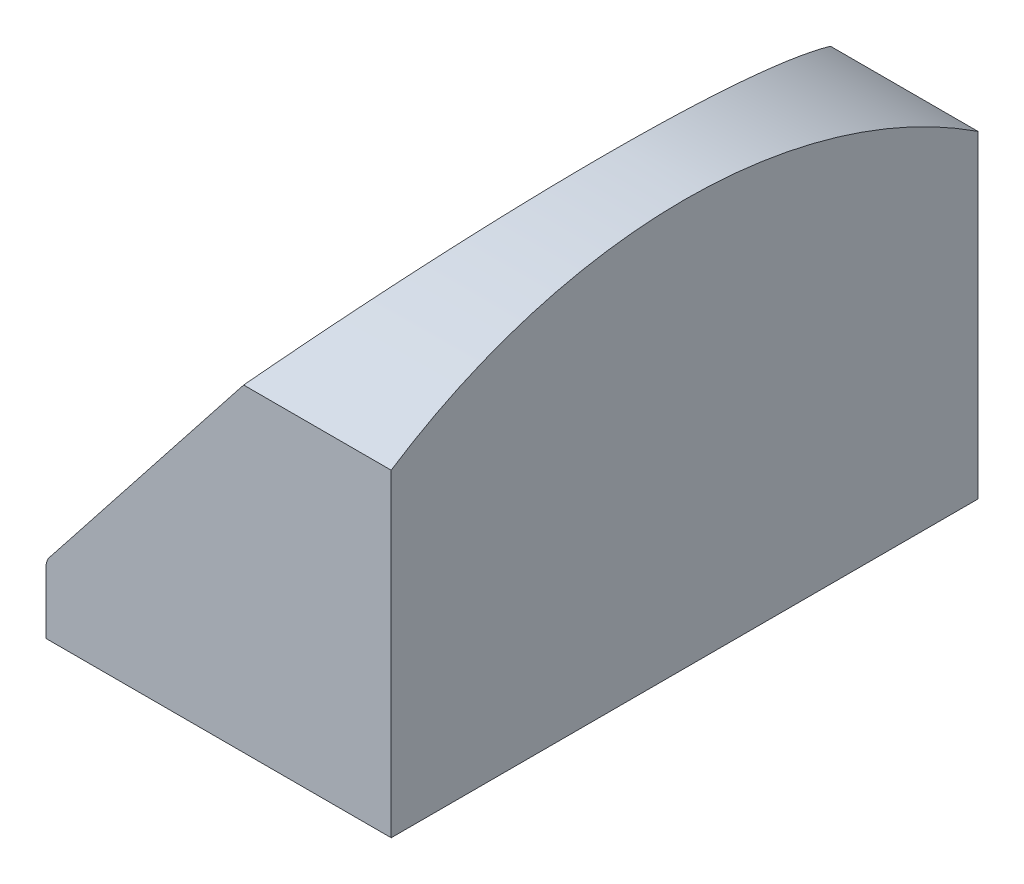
ISO-10303-21;
HEADER;
FILE_DESCRIPTION(('STEP AP214'),'2;1');
FILE_NAME('part.step','',(''),(''),'','','');
FILE_SCHEMA(('AUTOMOTIVE_DESIGN { 1 0 10303 214 1 1 1 1 }'));
ENDSEC;
DATA;
#1=APPLICATION_CONTEXT('core data for automotive mechanical design processes');
#2=APPLICATION_PROTOCOL_DEFINITION('international standard','automotive_design',2000,#1);
#3=PRODUCT_CONTEXT('',#1,'mechanical');
#4=PRODUCT('Part','Part','',(#3));
#5=PRODUCT_RELATED_PRODUCT_CATEGORY('part','',(#4));
#6=PRODUCT_DEFINITION_FORMATION('','',#4);
#7=PRODUCT_DEFINITION_CONTEXT('part definition',#1,'design');
#8=PRODUCT_DEFINITION('design','',#6,#7);
#9=PRODUCT_DEFINITION_SHAPE('','',#8);
#10=(LENGTH_UNIT() NAMED_UNIT(*) SI_UNIT(.MILLI.,.METRE.));
#11=(NAMED_UNIT(*) PLANE_ANGLE_UNIT() SI_UNIT($,.RADIAN.));
#12=(NAMED_UNIT(*) SI_UNIT($,.STERADIAN.) SOLID_ANGLE_UNIT());
#13=UNCERTAINTY_MEASURE_WITH_UNIT(LENGTH_MEASURE(1.E-05),#10,'distance_accuracy_value','');
#14=(GEOMETRIC_REPRESENTATION_CONTEXT(3) GLOBAL_UNCERTAINTY_ASSIGNED_CONTEXT((#13)) GLOBAL_UNIT_ASSIGNED_CONTEXT((#10,
#11,#12)) REPRESENTATION_CONTEXT('',''));
#15=CARTESIAN_POINT('',(0.,0.,0.));
#16=DIRECTION('',(0.,0.,1.));
#17=DIRECTION('',(1.,0.,0.));
#18=AXIS2_PLACEMENT_3D('',#15,#16,#17);
#19=CARTESIAN_POINT('',(0.164316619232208,1.35733725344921,8.49999999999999));
#20=DIRECTION('',(0.78543046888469,-0.618949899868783,0.));
#21=DIRECTION('',(0.618949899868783,0.78543046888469,0.));
#22=AXIS2_PLACEMENT_3D('',#19,#20,#21);
#23=PLANE('',#22);
#24=CARTESIAN_POINT('',(0.164316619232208,1.35733725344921,8.49999999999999));
#25=DIRECTION('',(-0.78543046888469,0.618949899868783,0.));
#26=DIRECTION('',(0.618949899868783,0.78543046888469,0.));
#27=AXIS2_PLACEMENT_3D('',#24,#25,#26);
#28=CIRCLE('',#27,12.1981012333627);
#29=CARTESIAN_POINT('',(6.11859129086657,8.91314871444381,16.));
#30=VERTEX_POINT('',#29);
#31=CARTESIAN_POINT('',(6.11859129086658,8.91314871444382,1.));
#32=VERTEX_POINT('',#31);
#33=EDGE_CURVE('E275',#30,#32,#28,.T.);
#34=ORIENTED_EDGE('',*,*,#33,.T.);
#35=DIRECTION('',(-0.618949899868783,-0.78543046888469,0.));
#36=VECTOR('',#35,1.);
#37=CARTESIAN_POINT('',(6.11859129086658,8.91314871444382,1.));
#38=LINE('',#37,#36);
#39=CARTESIAN_POINT('',(1.1617008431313,2.62299051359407,1.));
#40=VERTEX_POINT('',#39);
#41=EDGE_CURVE('E278',#32,#40,#38,.T.);
#42=ORIENTED_EDGE('',*,*,#41,.T.);
#43=DIRECTION('',(0.,0.,1.));
#44=VECTOR('',#43,1.);
#45=CARTESIAN_POINT('',(1.1617008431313,2.62299051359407,16.));
#46=LINE('',#45,#44);
#47=CARTESIAN_POINT('',(1.1617008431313,2.62299051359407,16.));
#48=VERTEX_POINT('',#47);
#49=EDGE_CURVE('E281',#40,#48,#46,.T.);
#50=ORIENTED_EDGE('',*,*,#49,.T.);
#51=DIRECTION('',(0.618949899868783,0.78543046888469,0.));
#52=VECTOR('',#51,1.);
#53=CARTESIAN_POINT('',(6.11859129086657,8.91314871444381,16.));
#54=LINE('',#53,#52);
#55=EDGE_CURVE('E284',#48,#30,#54,.T.);
#56=ORIENTED_EDGE('',*,*,#55,.T.);
#57=EDGE_LOOP('',(#34,#42,#50,#56));
#58=FACE_BOUND('',#57,.T.);
#59=CARTESIAN_POINT('',(3.94708370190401,6.15756506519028,10.5164987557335));
#60=DIRECTION('',(0.78543046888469,-0.618949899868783,0.));
#61=DIRECTION('',(0.618949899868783,0.78543046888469,0.));
#62=AXIS2_PLACEMENT_3D('',#59,#60,#61);
#63=CIRCLE('',#62,0.999999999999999);
#64=CARTESIAN_POINT('',(4.23612825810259,6.52435468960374,9.63223713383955));
#65=VERTEX_POINT('',#64);
#66=CARTESIAN_POINT('',(4.21740882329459,6.50060023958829,11.4160826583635));
#67=VERTEX_POINT('',#66);
#68=EDGE_CURVE('E191',#65,#67,#63,.T.);
#69=ORIENTED_EDGE('',*,*,#68,.F.);
#70=DIRECTION('',(0.618949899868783,0.78543046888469,0.));
#71=VECTOR('',#70,1.);
#72=CARTESIAN_POINT('',(4.23612825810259,6.52435468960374,9.63223713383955));
#73=LINE('',#72,#71);
#74=CARTESIAN_POINT('',(2.70049657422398,4.57568014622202,9.63223713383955));
#75=VERTEX_POINT('',#74);
#76=EDGE_CURVE('E226',#75,#65,#73,.T.);
#77=ORIENTED_EDGE('',*,*,#76,.F.);
#78=DIRECTION('',(0.,0.,1.));
#79=VECTOR('',#78,1.);
#80=CARTESIAN_POINT('',(2.70049657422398,4.57568014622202,9.63223713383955));
#81=LINE('',#80,#79);
#82=CARTESIAN_POINT('',(2.70049657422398,4.57568014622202,6.49863786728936));
#83=VERTEX_POINT('',#82);
#84=EDGE_CURVE('E223',#83,#75,#81,.T.);
#85=ORIENTED_EDGE('',*,*,#84,.F.);
#86=DIRECTION('',(-0.618949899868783,-0.78543046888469,0.));
#87=VECTOR('',#86,1.);
#88=CARTESIAN_POINT('',(4.23612825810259,6.52435468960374,6.49863786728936));
#89=LINE('',#88,#87);
#90=CARTESIAN_POINT('',(4.23612825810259,6.52435468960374,6.49863786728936));
#91=VERTEX_POINT('',#90);
#92=EDGE_CURVE('E220',#91,#83,#89,.T.);
#93=ORIENTED_EDGE('',*,*,#92,.F.);
#94=DIRECTION('',(0.,0.,-1.));
#95=VECTOR('',#94,1.);
#96=CARTESIAN_POINT('',(4.23612825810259,6.52435468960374,8.88042420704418));
#97=LINE('',#96,#95);
#98=CARTESIAN_POINT('',(4.23612825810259,6.52435468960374,8.88042420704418));
#99=VERTEX_POINT('',#98);
#100=EDGE_CURVE('E217',#99,#91,#97,.T.);
#101=ORIENTED_EDGE('',*,*,#100,.F.);
#102=CARTESIAN_POINT('',(3.52413136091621,5.62085012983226,10.5164987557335));
#103=DIRECTION('',(-0.78543046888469,0.618949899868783,0.));
#104=DIRECTION('',(0.618949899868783,0.78543046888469,0.));
#105=AXIS2_PLACEMENT_3D('',#102,#103,#104);
#106=CIRCLE('',#105,2.);
#107=CARTESIAN_POINT('',(4.12939783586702,6.38891670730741,12.2611265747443));
#108=VERTEX_POINT('',#107);
#109=EDGE_CURVE('E50',#108,#99,#106,.T.);
#110=ORIENTED_EDGE('',*,*,#109,.F.);
#111=DIRECTION('',(-0.102705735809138,-0.130330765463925,0.986136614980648));
#112=VECTOR('',#111,1.);
#113=CARTESIAN_POINT('',(4.12939783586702,6.38891670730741,12.2611265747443));
#114=LINE('',#113,#112);
#115=EDGE_CURVE('E45',#67,#108,#114,.T.);
#116=ORIENTED_EDGE('',*,*,#115,.F.);
#117=EDGE_LOOP('',(#69,#77,#85,#93,#101,#110,#116));
#118=FACE_BOUND('',#117,.T.);
#119=ADVANCED_FACE('F30',(#58,#118),#23,.F.);
#120=CARTESIAN_POINT('',(0.,1.78992857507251,17.));
#121=DIRECTION('',(1.,0.,0.));
#122=DIRECTION('',(0.,1.,0.));
#123=AXIS2_PLACEMENT_3D('',#120,#121,#122);
#124=PLANE('',#123);
#125=DIRECTION('',(0.,-1.,0.));
#126=VECTOR('',#125,1.);
#127=CARTESIAN_POINT('',(0.,1.78992857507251,0.));
#128=LINE('',#127,#126);
#129=CARTESIAN_POINT('',(0.,1.78992857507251,0.));
#130=VERTEX_POINT('',#129);
#131=CARTESIAN_POINT('',(0.,0.,0.));
#132=VERTEX_POINT('',#131);
#133=EDGE_CURVE('E303',#130,#132,#128,.T.);
#134=ORIENTED_EDGE('',*,*,#133,.T.);
#135=DIRECTION('',(0.,0.,-1.));
#136=VECTOR('',#135,1.);
#137=CARTESIAN_POINT('',(0.,0.,17.));
#138=LINE('',#137,#136);
#139=CARTESIAN_POINT('',(0.,0.,17.));
#140=VERTEX_POINT('',#139);
#141=EDGE_CURVE('E38',#140,#132,#138,.T.);
#142=ORIENTED_EDGE('',*,*,#141,.F.);
#143=DIRECTION('',(0.,-1.,0.));
#144=VECTOR('',#143,1.);
#145=CARTESIAN_POINT('',(0.,1.78992857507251,17.));
#146=LINE('',#145,#144);
#147=CARTESIAN_POINT('',(0.,1.78992857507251,17.));
#148=VERTEX_POINT('',#147);
#149=EDGE_CURVE('E315',#148,#140,#146,.T.);
#150=ORIENTED_EDGE('',*,*,#149,.F.);
#151=DIRECTION('',(0.,0.,-1.));
#152=VECTOR('',#151,1.);
#153=CARTESIAN_POINT('',(0.,1.78992857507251,17.));
#154=LINE('',#153,#152);
#155=EDGE_CURVE('E327',#148,#130,#154,.T.);
#156=ORIENTED_EDGE('',*,*,#155,.T.);
#157=EDGE_LOOP('',(#134,#142,#150,#156));
#158=FACE_BOUND('',#157,.T.);
#159=ADVANCED_FACE('F32',(#158),#124,.F.);
#160=CARTESIAN_POINT('',(0.,0.,17.));
#161=DIRECTION('',(0.,1.,0.));
#162=DIRECTION('',(0.,0.,1.));
#163=AXIS2_PLACEMENT_3D('',#160,#161,#162);
#164=PLANE('',#163);
#165=DIRECTION('',(1.,0.,0.));
#166=VECTOR('',#165,1.);
#167=CARTESIAN_POINT('',(0.,0.,0.));
#168=LINE('',#167,#166);
#169=CARTESIAN_POINT('',(10.,0.,0.));
#170=VERTEX_POINT('',#169);
#171=EDGE_CURVE('E306',#132,#170,#168,.T.);
#172=ORIENTED_EDGE('',*,*,#171,.T.);
#173=DIRECTION('',(0.,0.,-1.));
#174=VECTOR('',#173,1.);
#175=CARTESIAN_POINT('',(10.,0.,17.));
#176=LINE('',#175,#174);
#177=CARTESIAN_POINT('',(10.,0.,17.));
#178=VERTEX_POINT('',#177);
#179=EDGE_CURVE('E333',#178,#170,#176,.T.);
#180=ORIENTED_EDGE('',*,*,#179,.F.);
#181=DIRECTION('',(1.,0.,0.));
#182=VECTOR('',#181,1.);
#183=CARTESIAN_POINT('',(0.,0.,17.));
#184=LINE('',#183,#182);
#185=EDGE_CURVE('E318',#140,#178,#184,.T.);
#186=ORIENTED_EDGE('',*,*,#185,.F.);
#187=ORIENTED_EDGE('',*,*,#141,.T.);
#188=EDGE_LOOP('',(#172,#180,#186,#187));
#189=FACE_BOUND('',#188,.T.);
#190=ADVANCED_FACE('F338',(#189),#164,.F.);
#191=CARTESIAN_POINT('',(10.,0.,17.));
#192=DIRECTION('',(-1.,0.,0.));
#193=DIRECTION('',(0.,0.,1.));
#194=AXIS2_PLACEMENT_3D('',#191,#192,#193);
#195=PLANE('',#194);
#196=DIRECTION('',(0.,1.,0.));
#197=VECTOR('',#196,1.);
#198=CARTESIAN_POINT('',(10.,0.,0.));
#199=LINE('',#198,#197);
#200=CARTESIAN_POINT('',(10.,9.2226236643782,0.));
#201=VERTEX_POINT('',#200);
#202=EDGE_CURVE('E308',#170,#201,#199,.T.);
#203=ORIENTED_EDGE('',*,*,#202,.T.);
#204=CARTESIAN_POINT('',(10.,-3.74245760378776,8.5));
#205=DIRECTION('',(-1.,0.,0.));
#206=DIRECTION('',(0.,-1.,0.));
#207=AXIS2_PLACEMENT_3D('',#204,#205,#206);
#208=CIRCLE('',#207,15.5030104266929);
#209=CARTESIAN_POINT('',(10.,9.2226236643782,17.));
#210=VERTEX_POINT('',#209);
#211=EDGE_CURVE('E290',#210,#201,#208,.T.);
#212=ORIENTED_EDGE('',*,*,#211,.F.);
#213=DIRECTION('',(0.,1.,0.));
#214=VECTOR('',#213,1.);
#215=CARTESIAN_POINT('',(10.,0.,17.));
#216=LINE('',#215,#214);
#217=EDGE_CURVE('E320',#178,#210,#216,.T.);
#218=ORIENTED_EDGE('',*,*,#217,.F.);
#219=ORIENTED_EDGE('',*,*,#179,.T.);
#220=EDGE_LOOP('',(#203,#212,#218,#219));
#221=FACE_BOUND('',#220,.T.);
#222=ADVANCED_FACE('F352',(#221),#195,.F.);
#223=CARTESIAN_POINT('',(7.75694931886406,11.8,17.));
#224=DIRECTION('',(0.78543046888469,-0.618949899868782,0.));
#225=DIRECTION('',(0.618949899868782,0.78543046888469,0.));
#226=AXIS2_PLACEMENT_3D('',#223,#224,#225);
#227=PLANE('',#226);
#228=DIRECTION('',(-0.618949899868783,-0.78543046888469,0.));
#229=VECTOR('',#228,1.);
#230=CARTESIAN_POINT('',(5.72587605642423,9.22262366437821,1.));
#231=LINE('',#230,#229);
#232=CARTESIAN_POINT('',(5.72587605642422,9.22262366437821,1.));
#233=VERTEX_POINT('',#232);
#234=CARTESIAN_POINT('',(0.768985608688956,2.93246546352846,1.));
#235=VERTEX_POINT('',#234);
#236=EDGE_CURVE('E266',#233,#235,#231,.T.);
#237=ORIENTED_EDGE('',*,*,#236,.F.);
#238=CARTESIAN_POINT('',(-0.228398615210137,1.6668122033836,8.49999999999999));
#239=DIRECTION('',(-0.78543046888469,0.618949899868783,0.));
#240=DIRECTION('',(0.618949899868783,0.78543046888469,0.));
#241=AXIS2_PLACEMENT_3D('',#238,#239,#240);
#242=CIRCLE('',#241,12.1981012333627);
#243=CARTESIAN_POINT('',(5.72587605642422,9.2226236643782,16.));
#244=VERTEX_POINT('',#243);
#245=EDGE_CURVE('E264',#244,#233,#242,.T.);
#246=ORIENTED_EDGE('',*,*,#245,.F.);
#247=DIRECTION('',(0.618949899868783,0.78543046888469,0.));
#248=VECTOR('',#247,1.);
#249=CARTESIAN_POINT('',(5.72587605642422,9.2226236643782,16.));
#250=LINE('',#249,#248);
#251=CARTESIAN_POINT('',(0.768985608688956,2.93246546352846,16.));
#252=VERTEX_POINT('',#251);
#253=EDGE_CURVE('E272',#252,#244,#250,.T.);
#254=ORIENTED_EDGE('',*,*,#253,.F.);
#255=DIRECTION('',(0.,0.,1.));
#256=VECTOR('',#255,1.);
#257=CARTESIAN_POINT('',(0.768985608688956,2.93246546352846,16.));
#258=LINE('',#257,#256);
#259=EDGE_CURVE('E269',#235,#252,#258,.T.);
#260=ORIENTED_EDGE('',*,*,#259,.F.);
#261=EDGE_LOOP('',(#237,#246,#254,#260));
#262=FACE_BOUND('',#261,.T.);
#263=DIRECTION('',(-0.618949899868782,-0.78543046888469,0.));
#264=VECTOR('',#263,1.);
#265=CARTESIAN_POINT('',(7.75694931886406,11.8,17.));
#266=LINE('',#265,#264);
#267=CARTESIAN_POINT('',(5.72587605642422,9.22262366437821,17.));
#268=VERTEX_POINT('',#267);
#269=CARTESIAN_POINT('',(0.150035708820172,2.14703499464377,17.));
#270=VERTEX_POINT('',#269);
#271=EDGE_CURVE('E323',#268,#270,#266,.T.);
#272=ORIENTED_EDGE('',*,*,#271,.F.);
#273=CARTESIAN_POINT('',(-4.4911145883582,-3.74245760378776,8.5));
#274=DIRECTION('',(0.78543046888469,-0.618949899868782,0.));
#275=DIRECTION('',(0.618949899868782,0.78543046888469,0.));
#276=AXIS2_PLACEMENT_3D('',#273,#274,#275);
#277=ELLIPSE('',#276,19.7382340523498,15.5030104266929);
#278=CARTESIAN_POINT('',(5.72587605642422,9.22262366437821,0.));
#279=VERTEX_POINT('',#278);
#280=EDGE_CURVE('E300',#268,#279,#277,.F.);
#281=ORIENTED_EDGE('',*,*,#280,.T.);
#282=DIRECTION('',(-0.618949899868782,-0.78543046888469,0.));
#283=VECTOR('',#282,1.);
#284=CARTESIAN_POINT('',(7.75694931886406,11.8,0.));
#285=LINE('',#284,#283);
#286=CARTESIAN_POINT('',(0.150035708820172,2.14703499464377,0.));
#287=VERTEX_POINT('',#286);
#288=EDGE_CURVE('E311',#279,#287,#285,.T.);
#289=ORIENTED_EDGE('',*,*,#288,.T.);
#290=DIRECTION('',(0.,0.,-1.));
#291=VECTOR('',#290,1.);
#292=CARTESIAN_POINT('',(0.150035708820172,2.14703499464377,17.));
#293=LINE('',#292,#291);
#294=EDGE_CURVE('E330',#270,#287,#293,.T.);
#295=ORIENTED_EDGE('',*,*,#294,.F.);
#296=EDGE_LOOP('',(#272,#281,#289,#295));
#297=FACE_BOUND('',#296,.T.);
#298=ADVANCED_FACE('F363',(#262,#297),#227,.F.);
#299=CARTESIAN_POINT('',(0.500000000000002,1.78992857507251,17.));
#300=DIRECTION('',(0.,0.,-1.));
#301=DIRECTION('',(-1.,0.,0.));
#302=AXIS2_PLACEMENT_3D('',#299,#300,#301);
#303=CYLINDRICAL_SURFACE('',#302,0.500000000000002);
#304=CARTESIAN_POINT('',(0.500000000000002,1.78992857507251,0.));
#305=DIRECTION('',(0.,0.,1.));
#306=DIRECTION('',(-1.,0.,0.));
#307=AXIS2_PLACEMENT_3D('',#304,#305,#306);
#308=CIRCLE('',#307,0.500000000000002);
#309=EDGE_CURVE('E313',#287,#130,#308,.T.);
#310=ORIENTED_EDGE('',*,*,#309,.T.);
#311=ORIENTED_EDGE('',*,*,#155,.F.);
#312=CARTESIAN_POINT('',(0.500000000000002,1.78992857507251,17.));
#313=DIRECTION('',(0.,0.,1.));
#314=DIRECTION('',(-1.,0.,0.));
#315=AXIS2_PLACEMENT_3D('',#312,#313,#314);
#316=CIRCLE('',#315,0.500000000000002);
#317=EDGE_CURVE('E325',#270,#148,#316,.T.);
#318=ORIENTED_EDGE('',*,*,#317,.F.);
#319=ORIENTED_EDGE('',*,*,#294,.T.);
#320=EDGE_LOOP('',(#310,#311,#318,#319));
#321=FACE_BOUND('',#320,.T.);
#322=ADVANCED_FACE('F361',(#321),#303,.T.);
#323=CARTESIAN_POINT('',(0.500000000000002,1.78992857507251,17.));
#324=DIRECTION('',(0.,0.,-1.));
#325=DIRECTION('',(-1.,0.,0.));
#326=AXIS2_PLACEMENT_3D('',#323,#324,#325);
#327=PLANE('',#326);
#328=ORIENTED_EDGE('',*,*,#217,.T.);
#329=DIRECTION('',(1.,0.,0.));
#330=VECTOR('',#329,1.);
#331=CARTESIAN_POINT('',(0.,9.22262366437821,17.));
#332=LINE('',#331,#330);
#333=EDGE_CURVE('E298',#268,#210,#332,.T.);
#334=ORIENTED_EDGE('',*,*,#333,.F.);
#335=ORIENTED_EDGE('',*,*,#271,.T.);
#336=ORIENTED_EDGE('',*,*,#317,.T.);
#337=ORIENTED_EDGE('',*,*,#149,.T.);
#338=ORIENTED_EDGE('',*,*,#185,.T.);
#339=EDGE_LOOP('',(#328,#334,#335,#336,#337,#338));
#340=FACE_BOUND('',#339,.T.);
#341=ADVANCED_FACE('F356',(#340),#327,.F.);
#342=CARTESIAN_POINT('',(0.500000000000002,1.78992857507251,0.));
#343=DIRECTION('',(0.,0.,-1.));
#344=DIRECTION('',(-1.,0.,0.));
#345=AXIS2_PLACEMENT_3D('',#342,#343,#344);
#346=PLANE('',#345);
#347=DIRECTION('',(-1.,0.,0.));
#348=VECTOR('',#347,1.);
#349=CARTESIAN_POINT('',(0.500000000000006,9.22262366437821,0.));
#350=LINE('',#349,#348);
#351=EDGE_CURVE('E11',#201,#279,#350,.T.);
#352=ORIENTED_EDGE('',*,*,#351,.F.);
#353=ORIENTED_EDGE('',*,*,#202,.F.);
#354=ORIENTED_EDGE('',*,*,#171,.F.);
#355=ORIENTED_EDGE('',*,*,#133,.F.);
#356=ORIENTED_EDGE('',*,*,#309,.F.);
#357=ORIENTED_EDGE('',*,*,#288,.F.);
#358=EDGE_LOOP('',(#352,#353,#354,#355,#356,#357));
#359=FACE_BOUND('',#358,.T.);
#360=ADVANCED_FACE('F347',(#359),#346,.T.);
#361=CARTESIAN_POINT('',(0.,-3.74245760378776,8.5));
#362=DIRECTION('',(1.,0.,0.));
#363=DIRECTION('',(0.,1.,0.));
#364=AXIS2_PLACEMENT_3D('',#361,#362,#363);
#365=CYLINDRICAL_SURFACE('',#364,15.5030104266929);
#366=ORIENTED_EDGE('',*,*,#333,.T.);
#367=ORIENTED_EDGE('',*,*,#211,.T.);
#368=ORIENTED_EDGE('',*,*,#351,.T.);
#369=ORIENTED_EDGE('',*,*,#280,.F.);
#370=EDGE_LOOP('',(#366,#367,#368,#369));
#371=FACE_BOUND('',#370,.T.);
#372=ADVANCED_FACE('F365',(#371),#365,.T.);
#373=CARTESIAN_POINT('',(0.164316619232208,1.35733725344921,8.49999999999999));
#374=DIRECTION('',(-0.78543046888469,0.618949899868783,0.));
#375=DIRECTION('',(-0.618949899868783,-0.78543046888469,0.));
#376=AXIS2_PLACEMENT_3D('',#373,#374,#375);
#377=CYLINDRICAL_SURFACE('',#376,12.1981012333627);
#378=ORIENTED_EDGE('',*,*,#245,.T.);
#379=DIRECTION('',(-0.78543046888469,0.618949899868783,0.));
#380=VECTOR('',#379,1.);
#381=CARTESIAN_POINT('',(6.11859129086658,8.91314871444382,1.));
#382=LINE('',#381,#380);
#383=EDGE_CURVE('E287',#32,#233,#382,.T.);
#384=ORIENTED_EDGE('',*,*,#383,.F.);
#385=ORIENTED_EDGE('',*,*,#33,.F.);
#386=DIRECTION('',(-0.78543046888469,0.618949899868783,0.));
#387=VECTOR('',#386,1.);
#388=CARTESIAN_POINT('',(6.11859129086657,8.91314871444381,16.));
#389=LINE('',#388,#387);
#390=EDGE_CURVE('E288',#30,#244,#389,.T.);
#391=ORIENTED_EDGE('',*,*,#390,.T.);
#392=EDGE_LOOP('',(#378,#384,#385,#391));
#393=FACE_BOUND('',#392,.T.);
#394=ADVANCED_FACE('F367',(#393),#377,.F.);
#395=CARTESIAN_POINT('',(6.11859129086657,8.91314871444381,16.));
#396=DIRECTION('',(0.,0.,1.));
#397=DIRECTION('',(1.,0.,0.));
#398=AXIS2_PLACEMENT_3D('',#395,#396,#397);
#399=PLANE('',#398);
#400=ORIENTED_EDGE('',*,*,#253,.T.);
#401=ORIENTED_EDGE('',*,*,#390,.F.);
#402=ORIENTED_EDGE('',*,*,#55,.F.);
#403=DIRECTION('',(-0.78543046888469,0.618949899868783,0.));
#404=VECTOR('',#403,1.);
#405=CARTESIAN_POINT('',(1.1617008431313,2.62299051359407,16.));
#406=LINE('',#405,#404);
#407=EDGE_CURVE('E291',#48,#252,#406,.T.);
#408=ORIENTED_EDGE('',*,*,#407,.T.);
#409=EDGE_LOOP('',(#400,#401,#402,#408));
#410=FACE_BOUND('',#409,.T.);
#411=ADVANCED_FACE('F373',(#410),#399,.F.);
#412=CARTESIAN_POINT('',(1.1617008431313,2.62299051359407,16.));
#413=DIRECTION('',(-0.618949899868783,-0.78543046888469,0.));
#414=DIRECTION('',(0.78543046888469,-0.618949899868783,0.));
#415=AXIS2_PLACEMENT_3D('',#412,#413,#414);
#416=PLANE('',#415);
#417=ORIENTED_EDGE('',*,*,#259,.T.);
#418=ORIENTED_EDGE('',*,*,#407,.F.);
#419=ORIENTED_EDGE('',*,*,#49,.F.);
#420=DIRECTION('',(-0.78543046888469,0.618949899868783,0.));
#421=VECTOR('',#420,1.);
#422=CARTESIAN_POINT('',(1.1617008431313,2.62299051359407,1.));
#423=LINE('',#422,#421);
#424=EDGE_CURVE('E293',#40,#235,#423,.T.);
#425=ORIENTED_EDGE('',*,*,#424,.T.);
#426=EDGE_LOOP('',(#417,#418,#419,#425));
#427=FACE_BOUND('',#426,.T.);
#428=ADVANCED_FACE('F536',(#427),#416,.F.);
#429=CARTESIAN_POINT('',(6.11859129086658,8.91314871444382,1.));
#430=DIRECTION('',(0.,0.,-1.));
#431=DIRECTION('',(-1.,0.,0.));
#432=AXIS2_PLACEMENT_3D('',#429,#430,#431);
#433=PLANE('',#432);
#434=ORIENTED_EDGE('',*,*,#236,.T.);
#435=ORIENTED_EDGE('',*,*,#424,.F.);
#436=ORIENTED_EDGE('',*,*,#41,.F.);
#437=ORIENTED_EDGE('',*,*,#383,.T.);
#438=EDGE_LOOP('',(#434,#435,#436,#437));
#439=FACE_BOUND('',#438,.T.);
#440=ADVANCED_FACE('F408',(#439),#433,.F.);
#441=CARTESIAN_POINT('',(3.78999760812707,6.28135504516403,10.5164987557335));
#442=DIRECTION('',(0.78543046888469,-0.618949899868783,0.));
#443=DIRECTION('',(0.618949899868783,0.78543046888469,0.));
#444=AXIS2_PLACEMENT_3D('',#441,#442,#443);
#445=PLANE('',#444);
#446=CARTESIAN_POINT('',(3.78999760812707,6.28135504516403,10.5164987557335));
#447=DIRECTION('',(0.78543046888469,-0.618949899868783,0.));
#448=DIRECTION('',(0.618949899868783,0.78543046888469,0.));
#449=AXIS2_PLACEMENT_3D('',#446,#447,#448);
#450=CIRCLE('',#449,0.999999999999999);
#451=CARTESIAN_POINT('',(4.07904216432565,6.6481446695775,9.63223713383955));
#452=VERTEX_POINT('',#451);
#453=CARTESIAN_POINT('',(4.06032272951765,6.62439021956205,11.4160826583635));
#454=VERTEX_POINT('',#453);
#455=EDGE_CURVE('E229',#452,#454,#450,.T.);
#456=ORIENTED_EDGE('',*,*,#455,.T.);
#457=DIRECTION('',(-0.102705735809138,-0.130330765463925,0.986136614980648));
#458=VECTOR('',#457,1.);
#459=CARTESIAN_POINT('',(3.97231174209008,6.51270668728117,12.2611265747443));
#460=LINE('',#459,#458);
#461=CARTESIAN_POINT('',(3.97231174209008,6.51270668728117,12.2611265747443));
#462=VERTEX_POINT('',#461);
#463=EDGE_CURVE('E232',#454,#462,#460,.T.);
#464=ORIENTED_EDGE('',*,*,#463,.T.);
#465=CARTESIAN_POINT('',(3.36704526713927,5.74464010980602,10.5164987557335));
#466=DIRECTION('',(-0.78543046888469,0.618949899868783,0.));
#467=DIRECTION('',(0.618949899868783,0.78543046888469,0.));
#468=AXIS2_PLACEMENT_3D('',#465,#466,#467);
#469=CIRCLE('',#468,2.);
#470=CARTESIAN_POINT('',(4.07904216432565,6.6481446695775,8.88042420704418));
#471=VERTEX_POINT('',#470);
#472=EDGE_CURVE('E234',#462,#471,#469,.T.);
#473=ORIENTED_EDGE('',*,*,#472,.T.);
#474=DIRECTION('',(0.,0.,-1.));
#475=VECTOR('',#474,1.);
#476=CARTESIAN_POINT('',(4.07904216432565,6.6481446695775,8.88042420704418));
#477=LINE('',#476,#475);
#478=CARTESIAN_POINT('',(4.07904216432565,6.6481446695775,6.49863786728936));
#479=VERTEX_POINT('',#478);
#480=EDGE_CURVE('E236',#471,#479,#477,.T.);
#481=ORIENTED_EDGE('',*,*,#480,.T.);
#482=DIRECTION('',(-0.618949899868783,-0.78543046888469,0.));
#483=VECTOR('',#482,1.);
#484=CARTESIAN_POINT('',(4.07904216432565,6.6481446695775,6.49863786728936));
#485=LINE('',#484,#483);
#486=CARTESIAN_POINT('',(2.54341048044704,4.69947012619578,6.49863786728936));
#487=VERTEX_POINT('',#486);
#488=EDGE_CURVE('E238',#479,#487,#485,.T.);
#489=ORIENTED_EDGE('',*,*,#488,.T.);
#490=DIRECTION('',(0.,0.,1.));
#491=VECTOR('',#490,1.);
#492=CARTESIAN_POINT('',(2.54341048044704,4.69947012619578,9.63223713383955));
#493=LINE('',#492,#491);
#494=CARTESIAN_POINT('',(2.54341048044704,4.69947012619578,9.63223713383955));
#495=VERTEX_POINT('',#494);
#496=EDGE_CURVE('E240',#487,#495,#493,.T.);
#497=ORIENTED_EDGE('',*,*,#496,.T.);
#498=DIRECTION('',(0.618949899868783,0.78543046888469,0.));
#499=VECTOR('',#498,1.);
#500=CARTESIAN_POINT('',(4.07904216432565,6.6481446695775,9.63223713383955));
#501=LINE('',#500,#499);
#502=EDGE_CURVE('E242',#495,#452,#501,.T.);
#503=ORIENTED_EDGE('',*,*,#502,.T.);
#504=EDGE_LOOP('',(#456,#464,#473,#481,#489,#497,#503));
#505=FACE_BOUND('',#504,.T.);
#506=DIRECTION('',(-0.618949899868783,-0.785430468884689,0.));
#507=VECTOR('',#506,1.);
#508=CARTESIAN_POINT('',(3.19459456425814,5.52580489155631,7.62945851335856));
#509=LINE('',#508,#507);
#510=CARTESIAN_POINT('',(3.19459456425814,5.52580489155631,7.62945851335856));
#511=VERTEX_POINT('',#510);
#512=CARTESIAN_POINT('',(2.86015359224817,5.10140845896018,7.62945851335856));
#513=VERTEX_POINT('',#512);
#514=EDGE_CURVE('E190',#511,#513,#509,.T.);
#515=ORIENTED_EDGE('',*,*,#514,.F.);
#516=DIRECTION('',(0.,0.,-1.));
#517=VECTOR('',#516,1.);
#518=CARTESIAN_POINT('',(3.19459456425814,5.52580489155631,7.62945851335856));
#519=LINE('',#518,#517);
#520=CARTESIAN_POINT('',(3.19459456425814,5.52580489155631,8.13977593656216));
#521=VERTEX_POINT('',#520);
#522=EDGE_CURVE('E206',#521,#511,#519,.T.);
#523=ORIENTED_EDGE('',*,*,#522,.F.);
#524=DIRECTION('',(0.618949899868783,0.785430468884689,0.));
#525=VECTOR('',#524,1.);
#526=CARTESIAN_POINT('',(3.19459456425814,5.52580489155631,8.13977593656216));
#527=LINE('',#526,#525);
#528=CARTESIAN_POINT('',(2.86015359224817,5.10140845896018,8.13977593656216));
#529=VERTEX_POINT('',#528);
#530=EDGE_CURVE('E203',#529,#521,#527,.T.);
#531=ORIENTED_EDGE('',*,*,#530,.F.);
#532=DIRECTION('',(0.,0.,1.));
#533=VECTOR('',#532,1.);
#534=CARTESIAN_POINT('',(2.86015359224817,5.10140845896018,7.62945851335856));
#535=LINE('',#534,#533);
#536=EDGE_CURVE('E201',#513,#529,#535,.T.);
#537=ORIENTED_EDGE('',*,*,#536,.F.);
#538=EDGE_LOOP('',(#515,#523,#531,#537));
#539=FACE_BOUND('',#538,.T.);
#540=ADVANCED_FACE('F404',(#505,#539),#445,.F.);
#541=CARTESIAN_POINT('',(3.78999760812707,6.28135504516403,10.5164987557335));
#542=DIRECTION('',(0.78543046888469,-0.618949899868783,0.));
#543=DIRECTION('',(0.618949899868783,0.78543046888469,0.));
#544=AXIS2_PLACEMENT_3D('',#541,#542,#543);
#545=CYLINDRICAL_SURFACE('',#544,0.999999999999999);
#546=ORIENTED_EDGE('',*,*,#68,.T.);
#547=DIRECTION('',(0.78543046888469,-0.618949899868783,0.));
#548=VECTOR('',#547,1.);
#549=CARTESIAN_POINT('',(4.06032272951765,6.62439021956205,11.4160826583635));
#550=LINE('',#549,#548);
#551=EDGE_CURVE('E262',#454,#67,#550,.T.);
#552=ORIENTED_EDGE('',*,*,#551,.F.);
#553=ORIENTED_EDGE('',*,*,#455,.F.);
#554=DIRECTION('',(0.78543046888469,-0.618949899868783,0.));
#555=VECTOR('',#554,1.);
#556=CARTESIAN_POINT('',(4.07904216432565,6.6481446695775,9.63223713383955));
#557=LINE('',#556,#555);
#558=EDGE_CURVE('E244',#452,#65,#557,.T.);
#559=ORIENTED_EDGE('',*,*,#558,.T.);
#560=EDGE_LOOP('',(#546,#552,#553,#559));
#561=FACE_BOUND('',#560,.T.);
#562=ADVANCED_FACE('F407',(#561),#545,.F.);
#563=CARTESIAN_POINT('',(3.97231174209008,6.51270668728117,12.2611265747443));
#564=DIRECTION('',(0.610369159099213,0.774541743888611,0.165935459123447));
#565=DIRECTION('',(-0.78543046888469,0.618949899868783,0.));
#566=AXIS2_PLACEMENT_3D('',#563,#564,#565);
#567=PLANE('',#566);
#568=ORIENTED_EDGE('',*,*,#115,.T.);
#569=DIRECTION('',(0.78543046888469,-0.618949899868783,0.));
#570=VECTOR('',#569,1.);
#571=CARTESIAN_POINT('',(3.97231174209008,6.51270668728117,12.2611265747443));
#572=LINE('',#571,#570);
#573=EDGE_CURVE('E259',#462,#108,#572,.T.);
#574=ORIENTED_EDGE('',*,*,#573,.F.);
#575=ORIENTED_EDGE('',*,*,#463,.F.);
#576=ORIENTED_EDGE('',*,*,#551,.T.);
#577=EDGE_LOOP('',(#568,#574,#575,#576));
#578=FACE_BOUND('',#577,.T.);
#579=ADVANCED_FACE('F428',(#578),#567,.F.);
#580=CARTESIAN_POINT('',(3.36704526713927,5.74464010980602,10.5164987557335));
#581=DIRECTION('',(0.78543046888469,-0.618949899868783,0.));
#582=DIRECTION('',(0.618949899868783,0.78543046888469,0.));
#583=AXIS2_PLACEMENT_3D('',#580,#581,#582);
#584=CYLINDRICAL_SURFACE('',#583,2.);
#585=ORIENTED_EDGE('',*,*,#109,.T.);
#586=DIRECTION('',(0.78543046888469,-0.618949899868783,0.));
#587=VECTOR('',#586,1.);
#588=CARTESIAN_POINT('',(4.07904216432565,6.6481446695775,8.88042420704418));
#589=LINE('',#588,#587);
#590=EDGE_CURVE('E256',#471,#99,#589,.T.);
#591=ORIENTED_EDGE('',*,*,#590,.F.);
#592=ORIENTED_EDGE('',*,*,#472,.F.);
#593=ORIENTED_EDGE('',*,*,#573,.T.);
#594=EDGE_LOOP('',(#585,#591,#592,#593));
#595=FACE_BOUND('',#594,.T.);
#596=ADVANCED_FACE('F424',(#595),#584,.T.);
#597=CARTESIAN_POINT('',(4.07904216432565,6.6481446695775,8.88042420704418));
#598=DIRECTION('',(-0.618949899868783,-0.78543046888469,0.));
#599=DIRECTION('',(0.78543046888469,-0.618949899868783,0.));
#600=AXIS2_PLACEMENT_3D('',#597,#598,#599);
#601=PLANE('',#600);
#602=ORIENTED_EDGE('',*,*,#100,.T.);
#603=DIRECTION('',(0.78543046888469,-0.618949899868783,0.));
#604=VECTOR('',#603,1.);
#605=CARTESIAN_POINT('',(4.07904216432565,6.6481446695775,6.49863786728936));
#606=LINE('',#605,#604);
#607=EDGE_CURVE('E253',#479,#91,#606,.T.);
#608=ORIENTED_EDGE('',*,*,#607,.F.);
#609=ORIENTED_EDGE('',*,*,#480,.F.);
#610=ORIENTED_EDGE('',*,*,#590,.T.);
#611=EDGE_LOOP('',(#602,#608,#609,#610));
#612=FACE_BOUND('',#611,.T.);
#613=ADVANCED_FACE('F420',(#612),#601,.F.);
#614=CARTESIAN_POINT('',(4.07904216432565,6.6481446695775,6.49863786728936));
#615=DIRECTION('',(0.,0.,1.));
#616=DIRECTION('',(1.,0.,0.));
#617=AXIS2_PLACEMENT_3D('',#614,#615,#616);
#618=PLANE('',#617);
#619=ORIENTED_EDGE('',*,*,#92,.T.);
#620=DIRECTION('',(0.78543046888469,-0.618949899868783,0.));
#621=VECTOR('',#620,1.);
#622=CARTESIAN_POINT('',(2.54341048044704,4.69947012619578,6.49863786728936));
#623=LINE('',#622,#621);
#624=EDGE_CURVE('E250',#487,#83,#623,.T.);
#625=ORIENTED_EDGE('',*,*,#624,.F.);
#626=ORIENTED_EDGE('',*,*,#488,.F.);
#627=ORIENTED_EDGE('',*,*,#607,.T.);
#628=EDGE_LOOP('',(#619,#625,#626,#627));
#629=FACE_BOUND('',#628,.T.);
#630=ADVANCED_FACE('F416',(#629),#618,.F.);
#631=CARTESIAN_POINT('',(2.54341048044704,4.69947012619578,9.63223713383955));
#632=DIRECTION('',(0.618949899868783,0.78543046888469,0.));
#633=DIRECTION('',(-0.78543046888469,0.618949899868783,0.));
#634=AXIS2_PLACEMENT_3D('',#631,#632,#633);
#635=PLANE('',#634);
#636=ORIENTED_EDGE('',*,*,#84,.T.);
#637=DIRECTION('',(0.78543046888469,-0.618949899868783,0.));
#638=VECTOR('',#637,1.);
#639=CARTESIAN_POINT('',(2.54341048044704,4.69947012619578,9.63223713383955));
#640=LINE('',#639,#638);
#641=EDGE_CURVE('E247',#495,#75,#640,.T.);
#642=ORIENTED_EDGE('',*,*,#641,.F.);
#643=ORIENTED_EDGE('',*,*,#496,.F.);
#644=ORIENTED_EDGE('',*,*,#624,.T.);
#645=EDGE_LOOP('',(#636,#642,#643,#644));
#646=FACE_BOUND('',#645,.T.);
#647=ADVANCED_FACE('F412',(#646),#635,.F.);
#648=CARTESIAN_POINT('',(4.07904216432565,6.6481446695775,9.63223713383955));
#649=DIRECTION('',(0.,0.,-1.));
#650=DIRECTION('',(-1.,0.,0.));
#651=AXIS2_PLACEMENT_3D('',#648,#649,#650);
#652=PLANE('',#651);
#653=ORIENTED_EDGE('',*,*,#76,.T.);
#654=ORIENTED_EDGE('',*,*,#558,.F.);
#655=ORIENTED_EDGE('',*,*,#502,.F.);
#656=ORIENTED_EDGE('',*,*,#641,.T.);
#657=EDGE_LOOP('',(#653,#654,#655,#656));
#658=FACE_BOUND('',#657,.T.);
#659=ADVANCED_FACE('F403',(#658),#652,.F.);
#660=CARTESIAN_POINT('',(3.19459456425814,5.52580489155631,7.62945851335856));
#661=DIRECTION('',(0.,0.,1.));
#662=DIRECTION('',(1.,0.,0.));
#663=AXIS2_PLACEMENT_3D('',#660,#661,#662);
#664=PLANE('',#663);
#665=DIRECTION('',(-0.618949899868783,-0.785430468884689,0.));
#666=VECTOR('',#665,1.);
#667=CARTESIAN_POINT('',(3.35168065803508,5.40201491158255,7.62945851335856));
#668=LINE('',#667,#666);
#669=CARTESIAN_POINT('',(3.35168065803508,5.40201491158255,7.62945851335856));
#670=VERTEX_POINT('',#669);
#671=CARTESIAN_POINT('',(3.01723968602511,4.97761847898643,7.62945851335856));
#672=VERTEX_POINT('',#671);
#673=EDGE_CURVE('E182',#670,#672,#668,.T.);
#674=ORIENTED_EDGE('',*,*,#673,.F.);
#675=DIRECTION('',(0.78543046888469,-0.618949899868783,0.));
#676=VECTOR('',#675,1.);
#677=CARTESIAN_POINT('',(3.19459456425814,5.52580489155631,7.62945851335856));
#678=LINE('',#677,#676);
#679=EDGE_CURVE('E208',#511,#670,#678,.T.);
#680=ORIENTED_EDGE('',*,*,#679,.F.);
#681=ORIENTED_EDGE('',*,*,#514,.T.);
#682=DIRECTION('',(0.78543046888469,-0.618949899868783,0.));
#683=VECTOR('',#682,1.);
#684=CARTESIAN_POINT('',(2.86015359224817,5.10140845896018,7.62945851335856));
#685=LINE('',#684,#683);
#686=EDGE_CURVE('E173',#513,#672,#685,.T.);
#687=ORIENTED_EDGE('',*,*,#686,.T.);
#688=EDGE_LOOP('',(#674,#680,#681,#687));
#689=FACE_BOUND('',#688,.T.);
#690=ADVANCED_FACE('F186',(#689),#664,.T.);
#691=CARTESIAN_POINT('',(2.86015359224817,5.10140845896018,7.62945851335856));
#692=DIRECTION('',(0.618949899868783,0.78543046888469,0.));
#693=DIRECTION('',(-0.78543046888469,0.618949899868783,0.));
#694=AXIS2_PLACEMENT_3D('',#691,#692,#693);
#695=PLANE('',#694);
#696=DIRECTION('',(0.,0.,1.));
#697=VECTOR('',#696,1.);
#698=CARTESIAN_POINT('',(3.01723968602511,4.97761847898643,7.62945851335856));
#699=LINE('',#698,#697);
#700=CARTESIAN_POINT('',(3.01723968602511,4.97761847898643,8.13977593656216));
#701=VERTEX_POINT('',#700);
#702=EDGE_CURVE('E170',#672,#701,#699,.T.);
#703=ORIENTED_EDGE('',*,*,#702,.F.);
#704=ORIENTED_EDGE('',*,*,#686,.F.);
#705=ORIENTED_EDGE('',*,*,#536,.T.);
#706=DIRECTION('',(0.78543046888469,-0.618949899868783,0.));
#707=VECTOR('',#706,1.);
#708=CARTESIAN_POINT('',(2.86015359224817,5.10140845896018,8.13977593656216));
#709=LINE('',#708,#707);
#710=EDGE_CURVE('E176',#529,#701,#709,.T.);
#711=ORIENTED_EDGE('',*,*,#710,.T.);
#712=EDGE_LOOP('',(#703,#704,#705,#711));
#713=FACE_BOUND('',#712,.T.);
#714=ADVANCED_FACE('F172',(#713),#695,.T.);
#715=CARTESIAN_POINT('',(3.19459456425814,5.52580489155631,8.13977593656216));
#716=DIRECTION('',(0.,0.,-1.));
#717=DIRECTION('',(-1.,0.,0.));
#718=AXIS2_PLACEMENT_3D('',#715,#716,#717);
#719=PLANE('',#718);
#720=DIRECTION('',(0.618949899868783,0.785430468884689,0.));
#721=VECTOR('',#720,1.);
#722=CARTESIAN_POINT('',(3.35168065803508,5.40201491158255,8.13977593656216));
#723=LINE('',#722,#721);
#724=CARTESIAN_POINT('',(3.35168065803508,5.40201491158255,8.13977593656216));
#725=VERTEX_POINT('',#724);
#726=EDGE_CURVE('E181',#701,#725,#723,.T.);
#727=ORIENTED_EDGE('',*,*,#726,.F.);
#728=ORIENTED_EDGE('',*,*,#710,.F.);
#729=ORIENTED_EDGE('',*,*,#530,.T.);
#730=DIRECTION('',(0.78543046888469,-0.618949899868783,0.));
#731=VECTOR('',#730,1.);
#732=CARTESIAN_POINT('',(3.19459456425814,5.52580489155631,8.13977593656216));
#733=LINE('',#732,#731);
#734=EDGE_CURVE('E210',#521,#725,#733,.T.);
#735=ORIENTED_EDGE('',*,*,#734,.T.);
#736=EDGE_LOOP('',(#727,#728,#729,#735));
#737=FACE_BOUND('',#736,.T.);
#738=ADVANCED_FACE('F390',(#737),#719,.T.);
#739=CARTESIAN_POINT('',(3.19459456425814,5.52580489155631,7.62945851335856));
#740=DIRECTION('',(-0.618949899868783,-0.78543046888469,0.));
#741=DIRECTION('',(0.78543046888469,-0.618949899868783,0.));
#742=AXIS2_PLACEMENT_3D('',#739,#740,#741);
#743=PLANE('',#742);
#744=DIRECTION('',(0.,0.,-1.));
#745=VECTOR('',#744,1.);
#746=CARTESIAN_POINT('',(3.35168065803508,5.40201491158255,7.62945851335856));
#747=LINE('',#746,#745);
#748=EDGE_CURVE('E195',#725,#670,#747,.T.);
#749=ORIENTED_EDGE('',*,*,#748,.F.);
#750=ORIENTED_EDGE('',*,*,#734,.F.);
#751=ORIENTED_EDGE('',*,*,#522,.T.);
#752=ORIENTED_EDGE('',*,*,#679,.T.);
#753=EDGE_LOOP('',(#749,#750,#751,#752));
#754=FACE_BOUND('',#753,.T.);
#755=ADVANCED_FACE('F386',(#754),#743,.T.);
#756=ORIENTED_EDGE('',*,*,#748,.T.);
#757=ORIENTED_EDGE('',*,*,#673,.T.);
#758=ORIENTED_EDGE('',*,*,#702,.T.);
#759=ORIENTED_EDGE('',*,*,#726,.T.);
#760=EDGE_LOOP('',(#756,#757,#758,#759));
#761=FACE_BOUND('',#760,.T.);
#762=ADVANCED_FACE('F193',(#761),#23,.F.);
#763=CLOSED_SHELL('',(#119,#159,#190,#222,#298,#322,#341,#360,#372,#394,#411,#428,#440,#540,
#562,#579,#596,#613,#630,#647,#659,#690,#714,#738,#755,#762));
#764=MANIFOLD_SOLID_BREP('B2',#763);
#765=ADVANCED_BREP_SHAPE_REPRESENTATION('',(#18,#764),#14);
#766=SHAPE_DEFINITION_REPRESENTATION(#9,#765);
ENDSEC;
END-ISO-10303-21;
